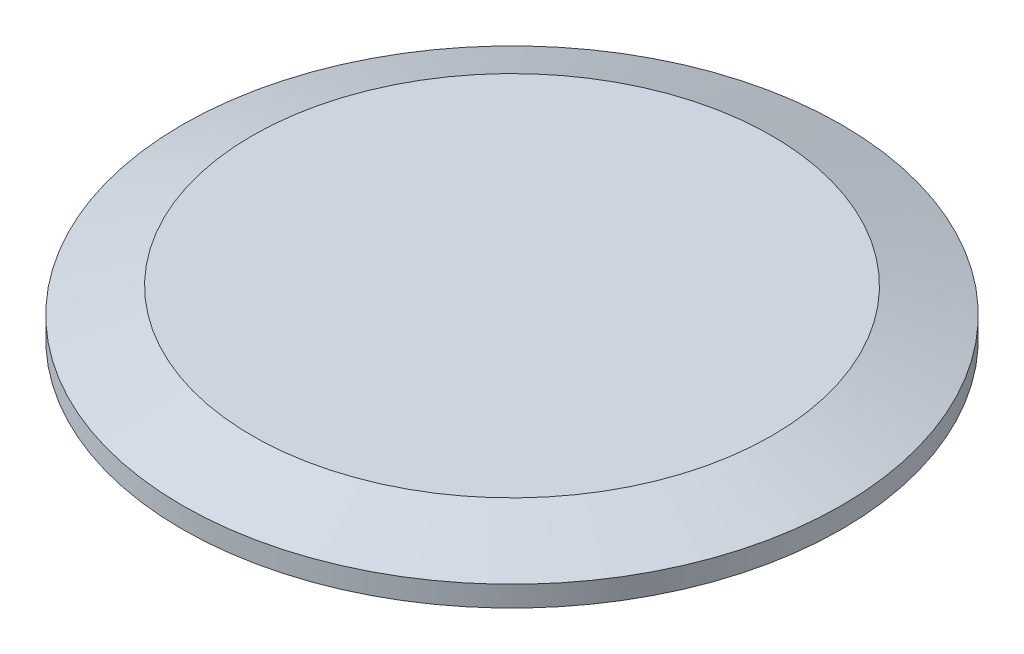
from build123d import *


with BuildPart() as part:
    # Sketch1 → Revolve1 (revolve)
    with BuildSketch(Plane.XY):
        with BuildLine():
            Line((0, 0), (-39.850691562, 0))
            ThreePointArc((-39.850691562, 0), (-40.282888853, 0.129217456), (-40.573233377, 0.474458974))
            ThreePointArc((-40.573233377, 0.474458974), (-41.6687, 1.1938), (-42.764166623, 0.474458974))
            ThreePointArc((-42.764166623, 0.474458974), (-43.054511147, 0.129217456), (-43.486708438, 0))
            Line((-43.486708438, 0), (-45.4533, 0))
            Line((-45.4533, 0), (-45.4533, 2.8448))
            Line((-45.4533, 2.8448), (-35.822842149, 6.35))
            Line((-35.822842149, 6.35), (0, 6.35))
            Line((0, 6.35), (0, 0))
        make_face()
    revolve(axis=Axis((0, 6.35, 0), (0, -1, 0)))


solid = part.part
